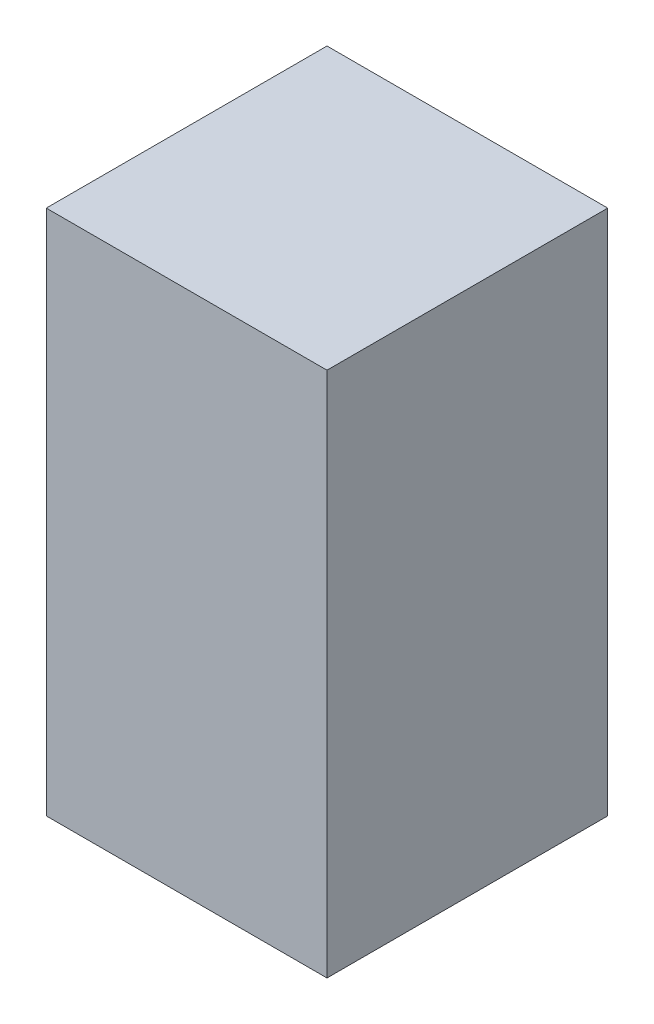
from build123d import *

# Parameters (mm, degrees)
ESQUISSE1_W        = 0.8
ESQUISSE1_H        = 1.5
BOSS_EXTRU_1_DEPTH = 0.8


with BuildPart() as part:
    # Esquisse1 → Boss.-Extru.1 (new body)
    with BuildSketch(Plane.XY):
        Rectangle(ESQUISSE1_W, ESQUISSE1_H)
    extrude(amount=BOSS_EXTRU_1_DEPTH)


solid = part.part
